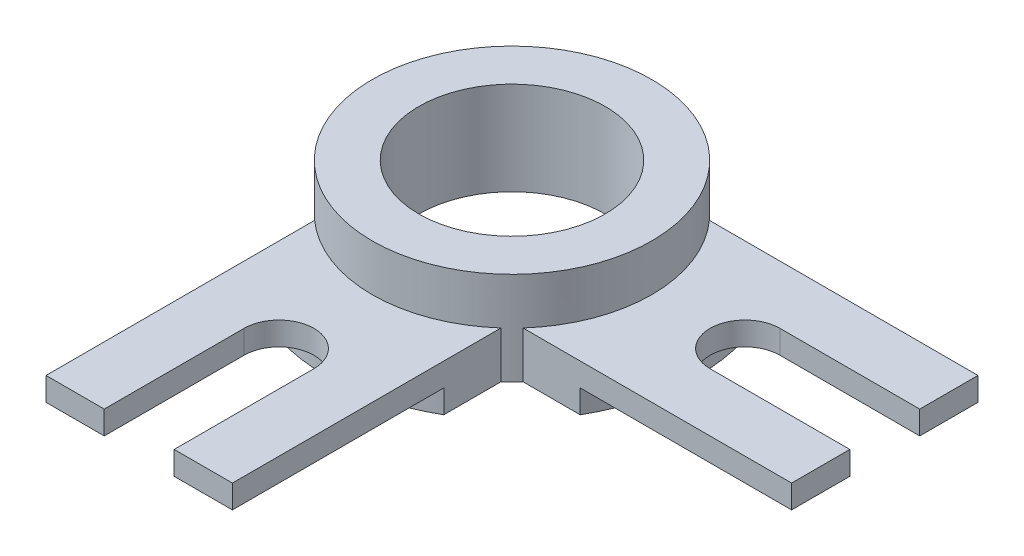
ISO-10303-21;
HEADER;
FILE_DESCRIPTION(('STEP AP214'),'2;1');
FILE_NAME('part.step','',(''),(''),'','','');
FILE_SCHEMA(('AUTOMOTIVE_DESIGN { 1 0 10303 214 1 1 1 1 }'));
ENDSEC;
DATA;
#1=APPLICATION_CONTEXT('core data for automotive mechanical design processes');
#2=APPLICATION_PROTOCOL_DEFINITION('international standard','automotive_design',2000,#1);
#3=PRODUCT_CONTEXT('',#1,'mechanical');
#4=PRODUCT('Part','Part','',(#3));
#5=PRODUCT_RELATED_PRODUCT_CATEGORY('part','',(#4));
#6=PRODUCT_DEFINITION_FORMATION('','',#4);
#7=PRODUCT_DEFINITION_CONTEXT('part definition',#1,'design');
#8=PRODUCT_DEFINITION('design','',#6,#7);
#9=PRODUCT_DEFINITION_SHAPE('','',#8);
#10=(LENGTH_UNIT() NAMED_UNIT(*) SI_UNIT(.MILLI.,.METRE.));
#11=(NAMED_UNIT(*) PLANE_ANGLE_UNIT() SI_UNIT($,.RADIAN.));
#12=(NAMED_UNIT(*) SI_UNIT($,.STERADIAN.) SOLID_ANGLE_UNIT());
#13=UNCERTAINTY_MEASURE_WITH_UNIT(LENGTH_MEASURE(1.E-05),#10,'distance_accuracy_value','');
#14=(GEOMETRIC_REPRESENTATION_CONTEXT(3) GLOBAL_UNCERTAINTY_ASSIGNED_CONTEXT((#13)) GLOBAL_UNIT_ASSIGNED_CONTEXT((#10,
#11,#12)) REPRESENTATION_CONTEXT('',''));
#15=CARTESIAN_POINT('',(0.,0.,0.));
#16=DIRECTION('',(0.,0.,1.));
#17=DIRECTION('',(1.,0.,0.));
#18=AXIS2_PLACEMENT_3D('',#15,#16,#17);
#19=CARTESIAN_POINT('',(-20.0000000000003,10.,79.9999999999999));
#20=DIRECTION('',(0.,0.,1.));
#21=DIRECTION('',(1.,0.,0.));
#22=AXIS2_PLACEMENT_3D('',#19,#20,#21);
#23=PLANE('',#22);
#24=DIRECTION('',(0.,1.,0.));
#25=VECTOR('',#24,1.);
#26=CARTESIAN_POINT('',(7.49999999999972,0.,80.));
#27=LINE('',#26,#25);
#28=CARTESIAN_POINT('',(7.49999999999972,5.,80.));
#29=VERTEX_POINT('',#28);
#30=CARTESIAN_POINT('',(7.49999999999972,10.,80.));
#31=VERTEX_POINT('',#30);
#32=EDGE_CURVE('E199',#29,#31,#27,.T.);
#33=ORIENTED_EDGE('',*,*,#32,.F.);
#34=DIRECTION('',(1.,0.,0.));
#35=VECTOR('',#34,1.);
#36=CARTESIAN_POINT('',(-20.0000000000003,5.,79.9999999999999));
#37=LINE('',#36,#35);
#38=CARTESIAN_POINT('',(19.9999999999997,5.,80.0000000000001));
#39=VERTEX_POINT('',#38);
#40=EDGE_CURVE('E335',#29,#39,#37,.T.);
#41=ORIENTED_EDGE('',*,*,#40,.T.);
#42=DIRECTION('',(0.,-1.,0.));
#43=VECTOR('',#42,1.);
#44=CARTESIAN_POINT('',(19.9999999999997,10.,80.0000000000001));
#45=LINE('',#44,#43);
#46=CARTESIAN_POINT('',(19.9999999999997,10.,80.0000000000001));
#47=VERTEX_POINT('',#46);
#48=EDGE_CURVE('E209',#47,#39,#45,.T.);
#49=ORIENTED_EDGE('',*,*,#48,.F.);
#50=DIRECTION('',(-1.,0.,0.));
#51=VECTOR('',#50,1.);
#52=CARTESIAN_POINT('',(-20.0000000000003,10.,79.9999999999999));
#53=LINE('',#52,#51);
#54=EDGE_CURVE('E317',#47,#31,#53,.T.);
#55=ORIENTED_EDGE('',*,*,#54,.T.);
#56=EDGE_LOOP('',(#33,#41,#49,#55));
#57=FACE_BOUND('',#56,.T.);
#58=ADVANCED_FACE('F33',(#57),#23,.T.);
#59=CARTESIAN_POINT('',(0.,0.,0.));
#60=DIRECTION('',(0.,1.,0.));
#61=DIRECTION('',(0.,0.,1.));
#62=AXIS2_PLACEMENT_3D('',#59,#60,#61);
#63=PLANE('',#62);
#64=CARTESIAN_POINT('',(0.,0.,0.));
#65=DIRECTION('',(0.,1.,0.));
#66=DIRECTION('',(0.,0.,1.));
#67=AXIS2_PLACEMENT_3D('',#64,#65,#66);
#68=CIRCLE('',#67,20.);
#69=CARTESIAN_POINT('',(0.,0.,20.));
#70=VERTEX_POINT('',#69);
#71=EDGE_CURVE('E180',#70,#70,#68,.T.);
#72=ORIENTED_EDGE('',*,*,#71,.T.);
#73=EDGE_LOOP('',(#72));
#74=FACE_BOUND('',#73,.T.);
#75=CARTESIAN_POINT('',(0.,0.,0.));
#76=DIRECTION('',(0.,-1.,0.));
#77=DIRECTION('',(1.,0.,0.));
#78=AXIS2_PLACEMENT_3D('',#75,#76,#77);
#79=CIRCLE('',#78,40.);
#80=CARTESIAN_POINT('',(19.9999999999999,0.,34.6410161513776));
#81=VERTEX_POINT('',#80);
#82=CARTESIAN_POINT('',(-20.0000000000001,0.,34.6410161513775));
#83=VERTEX_POINT('',#82);
#84=EDGE_CURVE('E170',#81,#83,#79,.T.);
#85=ORIENTED_EDGE('',*,*,#84,.T.);
#86=DIRECTION('',(0.,0.,-1.));
#87=VECTOR('',#86,1.);
#88=CARTESIAN_POINT('',(-20.,0.,0.));
#89=LINE('',#88,#87);
#90=CARTESIAN_POINT('',(-20.0000000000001,0.,22.3606797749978));
#91=VERTEX_POINT('',#90);
#92=EDGE_CURVE('E194',#83,#91,#89,.T.);
#93=ORIENTED_EDGE('',*,*,#92,.T.);
#94=CARTESIAN_POINT('',(0.,0.,0.));
#95=DIRECTION('',(0.,1.,0.));
#96=DIRECTION('',(0.,0.,1.));
#97=AXIS2_PLACEMENT_3D('',#94,#95,#96);
#98=CIRCLE('',#97,30.);
#99=CARTESIAN_POINT('',(22.3606797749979,0.,-20.));
#100=VERTEX_POINT('',#99);
#101=EDGE_CURVE('E281',#100,#91,#98,.T.);
#102=ORIENTED_EDGE('',*,*,#101,.F.);
#103=DIRECTION('',(1.,0.,0.));
#104=VECTOR('',#103,1.);
#105=CARTESIAN_POINT('',(0.,0.,-20.));
#106=LINE('',#105,#104);
#107=CARTESIAN_POINT('',(34.6410161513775,0.,-20.));
#108=VERTEX_POINT('',#107);
#109=EDGE_CURVE('E247',#100,#108,#106,.T.);
#110=ORIENTED_EDGE('',*,*,#109,.T.);
#111=CARTESIAN_POINT('',(0.,0.,0.));
#112=DIRECTION('',(0.,-1.,0.));
#113=DIRECTION('',(0.,0.,-1.));
#114=AXIS2_PLACEMENT_3D('',#111,#112,#113);
#115=CIRCLE('',#114,40.);
#116=CARTESIAN_POINT('',(34.6410161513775,0.,20.));
#117=VERTEX_POINT('',#116);
#118=EDGE_CURVE('E208',#108,#117,#115,.T.);
#119=ORIENTED_EDGE('',*,*,#118,.T.);
#120=DIRECTION('',(-1.,0.,0.));
#121=VECTOR('',#120,1.);
#122=CARTESIAN_POINT('',(0.,0.,20.));
#123=LINE('',#122,#121);
#124=CARTESIAN_POINT('',(22.3606797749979,0.,20.));
#125=VERTEX_POINT('',#124);
#126=EDGE_CURVE('E256',#117,#125,#123,.T.);
#127=ORIENTED_EDGE('',*,*,#126,.T.);
#128=CARTESIAN_POINT('',(19.9999999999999,0.,22.360679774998));
#129=VERTEX_POINT('',#128);
#130=EDGE_CURVE('E192',#129,#125,#98,.T.);
#131=ORIENTED_EDGE('',*,*,#130,.F.);
#132=DIRECTION('',(0.,0.,1.));
#133=VECTOR('',#132,1.);
#134=CARTESIAN_POINT('',(20.,0.,0.));
#135=LINE('',#134,#133);
#136=EDGE_CURVE('E188',#129,#81,#135,.T.);
#137=ORIENTED_EDGE('',*,*,#136,.T.);
#138=EDGE_LOOP('',(#85,#93,#102,#110,#119,#127,#131,#137));
#139=FACE_BOUND('',#138,.T.);
#140=ADVANCED_FACE('F190',(#74,#139),#63,.F.);
#141=CARTESIAN_POINT('',(-20.,10.,0.));
#142=DIRECTION('',(-1.,0.,0.));
#143=DIRECTION('',(0.,0.,1.));
#144=AXIS2_PLACEMENT_3D('',#141,#142,#143);
#145=PLANE('',#144);
#146=DIRECTION('',(0.,-1.,0.));
#147=VECTOR('',#146,1.);
#148=CARTESIAN_POINT('',(-20.0000000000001,5.,34.6410161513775));
#149=LINE('',#148,#147);
#150=CARTESIAN_POINT('',(-20.0000000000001,5.,34.6410161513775));
#151=VERTEX_POINT('',#150);
#152=EDGE_CURVE('E175',#83,#151,#149,.F.);
#153=ORIENTED_EDGE('',*,*,#152,.T.);
#154=DIRECTION('',(0.,0.,1.));
#155=VECTOR('',#154,1.);
#156=CARTESIAN_POINT('',(-20.,5.,0.));
#157=LINE('',#156,#155);
#158=CARTESIAN_POINT('',(-20.0000000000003,5.,79.9999999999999));
#159=VERTEX_POINT('',#158);
#160=EDGE_CURVE('E304',#151,#159,#157,.T.);
#161=ORIENTED_EDGE('',*,*,#160,.T.);
#162=DIRECTION('',(0.,-1.,0.));
#163=VECTOR('',#162,1.);
#164=CARTESIAN_POINT('',(-20.0000000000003,10.,79.9999999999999));
#165=LINE('',#164,#163);
#166=CARTESIAN_POINT('',(-20.0000000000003,10.,79.9999999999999));
#167=VERTEX_POINT('',#166);
#168=EDGE_CURVE('E205',#167,#159,#165,.T.);
#169=ORIENTED_EDGE('',*,*,#168,.F.);
#170=DIRECTION('',(0.,0.,-1.));
#171=VECTOR('',#170,1.);
#172=CARTESIAN_POINT('',(-20.,10.,0.));
#173=LINE('',#172,#171);
#174=CARTESIAN_POINT('',(-20.0000000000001,10.,22.3606797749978));
#175=VERTEX_POINT('',#174);
#176=EDGE_CURVE('E202',#167,#175,#173,.T.);
#177=ORIENTED_EDGE('',*,*,#176,.T.);
#178=DIRECTION('',(0.,-1.,0.));
#179=VECTOR('',#178,1.);
#180=CARTESIAN_POINT('',(-20.0000000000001,20.,22.3606797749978));
#181=LINE('',#180,#179);
#182=EDGE_CURVE('E296',#91,#175,#181,.F.);
#183=ORIENTED_EDGE('',*,*,#182,.F.);
#184=ORIENTED_EDGE('',*,*,#92,.F.);
#185=EDGE_LOOP('',(#153,#161,#169,#177,#183,#184));
#186=FACE_BOUND('',#185,.T.);
#187=ADVANCED_FACE('F327',(#186),#145,.T.);
#188=CARTESIAN_POINT('',(20.,10.,0.));
#189=DIRECTION('',(1.,0.,0.));
#190=DIRECTION('',(0.,0.,-1.));
#191=AXIS2_PLACEMENT_3D('',#188,#189,#190);
#192=PLANE('',#191);
#193=ORIENTED_EDGE('',*,*,#48,.T.);
#194=DIRECTION('',(0.,0.,-1.));
#195=VECTOR('',#194,1.);
#196=CARTESIAN_POINT('',(20.,5.,0.));
#197=LINE('',#196,#195);
#198=CARTESIAN_POINT('',(19.9999999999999,5.,34.6410161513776));
#199=VERTEX_POINT('',#198);
#200=EDGE_CURVE('E189',#39,#199,#197,.T.);
#201=ORIENTED_EDGE('',*,*,#200,.T.);
#202=DIRECTION('',(0.,-1.,0.));
#203=VECTOR('',#202,1.);
#204=CARTESIAN_POINT('',(19.9999999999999,5.,34.6410161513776));
#205=LINE('',#204,#203);
#206=EDGE_CURVE('E12',#199,#81,#205,.T.);
#207=ORIENTED_EDGE('',*,*,#206,.T.);
#208=ORIENTED_EDGE('',*,*,#136,.F.);
#209=DIRECTION('',(0.,-1.,0.));
#210=VECTOR('',#209,1.);
#211=CARTESIAN_POINT('',(19.9999999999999,20.,22.360679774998));
#212=LINE('',#211,#210);
#213=CARTESIAN_POINT('',(19.9999999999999,10.,22.360679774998));
#214=VERTEX_POINT('',#213);
#215=EDGE_CURVE('E294',#214,#129,#212,.T.);
#216=ORIENTED_EDGE('',*,*,#215,.F.);
#217=DIRECTION('',(0.,0.,1.));
#218=VECTOR('',#217,1.);
#219=CARTESIAN_POINT('',(20.,10.,0.));
#220=LINE('',#219,#218);
#221=EDGE_CURVE('E197',#214,#47,#220,.T.);
#222=ORIENTED_EDGE('',*,*,#221,.T.);
#223=EDGE_LOOP('',(#193,#201,#207,#208,#216,#222));
#224=FACE_BOUND('',#223,.T.);
#225=ADVANCED_FACE('F186',(#224),#192,.T.);
#226=ORIENTED_EDGE('',*,*,#168,.T.);
#227=DIRECTION('',(1.,0.,0.));
#228=VECTOR('',#227,1.);
#229=CARTESIAN_POINT('',(-20.0000000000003,5.,79.9999999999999));
#230=LINE('',#229,#228);
#231=CARTESIAN_POINT('',(-7.50000000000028,5.,80.));
#232=VERTEX_POINT('',#231);
#233=EDGE_CURVE('E298',#159,#232,#230,.T.);
#234=ORIENTED_EDGE('',*,*,#233,.T.);
#235=DIRECTION('',(0.,1.,0.));
#236=VECTOR('',#235,1.);
#237=CARTESIAN_POINT('',(-7.50000000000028,0.,80.));
#238=LINE('',#237,#236);
#239=CARTESIAN_POINT('',(-7.50000000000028,10.,80.));
#240=VERTEX_POINT('',#239);
#241=EDGE_CURVE('E56',#232,#240,#238,.T.);
#242=ORIENTED_EDGE('',*,*,#241,.T.);
#243=EDGE_CURVE('E316',#240,#167,#53,.T.);
#244=ORIENTED_EDGE('',*,*,#243,.T.);
#245=EDGE_LOOP('',(#226,#234,#242,#244));
#246=FACE_BOUND('',#245,.T.);
#247=ADVANCED_FACE('F302',(#246),#23,.T.);
#248=CARTESIAN_POINT('',(-1.78247987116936E-13,0.,50.));
#249=DIRECTION('',(0.,1.,0.));
#250=DIRECTION('',(0.,0.,1.));
#251=AXIS2_PLACEMENT_3D('',#248,#249,#250);
#252=CYLINDRICAL_SURFACE('',#251,7.5);
#253=CARTESIAN_POINT('',(-1.78247987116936E-13,5.,50.));
#254=DIRECTION('',(0.,-1.,0.));
#255=DIRECTION('',(0.,0.,-1.));
#256=AXIS2_PLACEMENT_3D('',#253,#254,#255);
#257=CIRCLE('',#256,7.5);
#258=CARTESIAN_POINT('',(7.49999999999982,5.,50.));
#259=VERTEX_POINT('',#258);
#260=CARTESIAN_POINT('',(-7.50000000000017,5.,50.));
#261=VERTEX_POINT('',#260);
#262=EDGE_CURVE('E48',#259,#261,#257,.F.);
#263=ORIENTED_EDGE('',*,*,#262,.F.);
#264=DIRECTION('',(0.,1.,0.));
#265=VECTOR('',#264,1.);
#266=CARTESIAN_POINT('',(7.49999999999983,0.,50.));
#267=LINE('',#266,#265);
#268=CARTESIAN_POINT('',(7.49999999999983,10.,50.));
#269=VERTEX_POINT('',#268);
#270=EDGE_CURVE('E195',#259,#269,#267,.T.);
#271=ORIENTED_EDGE('',*,*,#270,.T.);
#272=CARTESIAN_POINT('',(-1.78247987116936E-13,10.,50.));
#273=DIRECTION('',(0.,1.,0.));
#274=DIRECTION('',(-1.,0.,0.));
#275=AXIS2_PLACEMENT_3D('',#272,#273,#274);
#276=CIRCLE('',#275,7.5);
#277=CARTESIAN_POINT('',(-7.50000000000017,10.,50.));
#278=VERTEX_POINT('',#277);
#279=EDGE_CURVE('E339',#269,#278,#276,.T.);
#280=ORIENTED_EDGE('',*,*,#279,.T.);
#281=DIRECTION('',(0.,1.,0.));
#282=VECTOR('',#281,1.);
#283=CARTESIAN_POINT('',(-7.50000000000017,0.,50.));
#284=LINE('',#283,#282);
#285=EDGE_CURVE('E310',#261,#278,#284,.T.);
#286=ORIENTED_EDGE('',*,*,#285,.F.);
#287=EDGE_LOOP('',(#263,#271,#280,#286));
#288=FACE_BOUND('',#287,.T.);
#289=ADVANCED_FACE('F389',(#288),#252,.F.);
#290=CARTESIAN_POINT('',(7.49999999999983,0.,50.));
#291=DIRECTION('',(1.,0.,0.));
#292=DIRECTION('',(0.,0.,-1.));
#293=AXIS2_PLACEMENT_3D('',#290,#291,#292);
#294=PLANE('',#293);
#295=DIRECTION('',(0.,0.,-1.));
#296=VECTOR('',#295,1.);
#297=CARTESIAN_POINT('',(7.49999999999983,5.,50.));
#298=LINE('',#297,#296);
#299=EDGE_CURVE('E349',#29,#259,#298,.T.);
#300=ORIENTED_EDGE('',*,*,#299,.F.);
#301=ORIENTED_EDGE('',*,*,#32,.T.);
#302=DIRECTION('',(0.,0.,-1.));
#303=VECTOR('',#302,1.);
#304=CARTESIAN_POINT('',(7.49999999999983,10.,50.));
#305=LINE('',#304,#303);
#306=EDGE_CURVE('E313',#31,#269,#305,.T.);
#307=ORIENTED_EDGE('',*,*,#306,.T.);
#308=ORIENTED_EDGE('',*,*,#270,.F.);
#309=EDGE_LOOP('',(#300,#301,#307,#308));
#310=FACE_BOUND('',#309,.T.);
#311=ADVANCED_FACE('F394',(#310),#294,.F.);
#312=CARTESIAN_POINT('',(-7.50000000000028,0.,80.));
#313=DIRECTION('',(-1.,0.,0.));
#314=DIRECTION('',(0.,0.,1.));
#315=AXIS2_PLACEMENT_3D('',#312,#313,#314);
#316=PLANE('',#315);
#317=DIRECTION('',(0.,0.,1.));
#318=VECTOR('',#317,1.);
#319=CARTESIAN_POINT('',(-7.50000000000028,5.,80.));
#320=LINE('',#319,#318);
#321=EDGE_CURVE('E41',#261,#232,#320,.T.);
#322=ORIENTED_EDGE('',*,*,#321,.F.);
#323=ORIENTED_EDGE('',*,*,#285,.T.);
#324=DIRECTION('',(0.,0.,1.));
#325=VECTOR('',#324,1.);
#326=CARTESIAN_POINT('',(-7.50000000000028,10.,80.));
#327=LINE('',#326,#325);
#328=EDGE_CURVE('E308',#278,#240,#327,.T.);
#329=ORIENTED_EDGE('',*,*,#328,.T.);
#330=ORIENTED_EDGE('',*,*,#241,.F.);
#331=EDGE_LOOP('',(#322,#323,#329,#330));
#332=FACE_BOUND('',#331,.T.);
#333=ADVANCED_FACE('F306',(#332),#316,.F.);
#334=CARTESIAN_POINT('',(80.,10.,20.));
#335=DIRECTION('',(1.,0.,0.));
#336=DIRECTION('',(0.,0.,-1.));
#337=AXIS2_PLACEMENT_3D('',#334,#335,#336);
#338=PLANE('',#337);
#339=DIRECTION('',(0.,1.,0.));
#340=VECTOR('',#339,1.);
#341=CARTESIAN_POINT('',(80.,0.,-7.5));
#342=LINE('',#341,#340);
#343=CARTESIAN_POINT('',(80.,5.,-7.5));
#344=VERTEX_POINT('',#343);
#345=CARTESIAN_POINT('',(80.,10.,-7.5));
#346=VERTEX_POINT('',#345);
#347=EDGE_CURVE('E248',#344,#346,#342,.T.);
#348=ORIENTED_EDGE('',*,*,#347,.F.);
#349=DIRECTION('',(0.,0.,-1.));
#350=VECTOR('',#349,1.);
#351=CARTESIAN_POINT('',(80.,5.,20.));
#352=LINE('',#351,#350);
#353=CARTESIAN_POINT('',(80.,5.,-20.));
#354=VERTEX_POINT('',#353);
#355=EDGE_CURVE('E226',#344,#354,#352,.T.);
#356=ORIENTED_EDGE('',*,*,#355,.T.);
#357=DIRECTION('',(0.,-1.,0.));
#358=VECTOR('',#357,1.);
#359=CARTESIAN_POINT('',(80.,10.,-20.));
#360=LINE('',#359,#358);
#361=CARTESIAN_POINT('',(80.,10.,-20.));
#362=VERTEX_POINT('',#361);
#363=EDGE_CURVE('E263',#362,#354,#360,.T.);
#364=ORIENTED_EDGE('',*,*,#363,.F.);
#365=DIRECTION('',(0.,0.,1.));
#366=VECTOR('',#365,1.);
#367=CARTESIAN_POINT('',(80.,10.,20.));
#368=LINE('',#367,#366);
#369=EDGE_CURVE('E257',#362,#346,#368,.T.);
#370=ORIENTED_EDGE('',*,*,#369,.T.);
#371=EDGE_LOOP('',(#348,#356,#364,#370));
#372=FACE_BOUND('',#371,.T.);
#373=ADVANCED_FACE('F424',(#372),#338,.T.);
#374=CARTESIAN_POINT('',(0.,10.,20.));
#375=DIRECTION('',(0.,0.,1.));
#376=DIRECTION('',(1.,0.,0.));
#377=AXIS2_PLACEMENT_3D('',#374,#375,#376);
#378=PLANE('',#377);
#379=DIRECTION('',(0.,-1.,0.));
#380=VECTOR('',#379,1.);
#381=CARTESIAN_POINT('',(34.6410161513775,5.,20.));
#382=LINE('',#381,#380);
#383=CARTESIAN_POINT('',(34.6410161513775,5.,20.));
#384=VERTEX_POINT('',#383);
#385=EDGE_CURVE('E232',#117,#384,#382,.F.);
#386=ORIENTED_EDGE('',*,*,#385,.T.);
#387=DIRECTION('',(1.,0.,0.));
#388=VECTOR('',#387,1.);
#389=CARTESIAN_POINT('',(0.,5.,20.));
#390=LINE('',#389,#388);
#391=CARTESIAN_POINT('',(80.,5.,20.));
#392=VERTEX_POINT('',#391);
#393=EDGE_CURVE('E221',#384,#392,#390,.T.);
#394=ORIENTED_EDGE('',*,*,#393,.T.);
#395=DIRECTION('',(0.,-1.,0.));
#396=VECTOR('',#395,1.);
#397=CARTESIAN_POINT('',(80.,10.,20.));
#398=LINE('',#397,#396);
#399=CARTESIAN_POINT('',(80.,10.,20.));
#400=VERTEX_POINT('',#399);
#401=EDGE_CURVE('E267',#400,#392,#398,.T.);
#402=ORIENTED_EDGE('',*,*,#401,.F.);
#403=DIRECTION('',(-1.,0.,0.));
#404=VECTOR('',#403,1.);
#405=CARTESIAN_POINT('',(0.,10.,20.));
#406=LINE('',#405,#404);
#407=CARTESIAN_POINT('',(22.3606797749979,10.,20.));
#408=VERTEX_POINT('',#407);
#409=EDGE_CURVE('E260',#400,#408,#406,.T.);
#410=ORIENTED_EDGE('',*,*,#409,.T.);
#411=DIRECTION('',(0.,-1.,0.));
#412=VECTOR('',#411,1.);
#413=CARTESIAN_POINT('',(22.3606797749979,20.,20.));
#414=LINE('',#413,#412);
#415=EDGE_CURVE('E275',#125,#408,#414,.F.);
#416=ORIENTED_EDGE('',*,*,#415,.F.);
#417=ORIENTED_EDGE('',*,*,#126,.F.);
#418=EDGE_LOOP('',(#386,#394,#402,#410,#416,#417));
#419=FACE_BOUND('',#418,.T.);
#420=ADVANCED_FACE('F420',(#419),#378,.T.);
#421=CARTESIAN_POINT('',(0.,10.,-20.));
#422=DIRECTION('',(0.,0.,-1.));
#423=DIRECTION('',(-1.,0.,0.));
#424=AXIS2_PLACEMENT_3D('',#421,#422,#423);
#425=PLANE('',#424);
#426=ORIENTED_EDGE('',*,*,#363,.T.);
#427=DIRECTION('',(-1.,0.,0.));
#428=VECTOR('',#427,1.);
#429=CARTESIAN_POINT('',(0.,5.,-20.));
#430=LINE('',#429,#428);
#431=CARTESIAN_POINT('',(34.6410161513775,5.,-20.));
#432=VERTEX_POINT('',#431);
#433=EDGE_CURVE('E229',#354,#432,#430,.T.);
#434=ORIENTED_EDGE('',*,*,#433,.T.);
#435=DIRECTION('',(0.,-1.,0.));
#436=VECTOR('',#435,1.);
#437=CARTESIAN_POINT('',(34.6410161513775,5.,-20.));
#438=LINE('',#437,#436);
#439=EDGE_CURVE('E288',#432,#108,#438,.T.);
#440=ORIENTED_EDGE('',*,*,#439,.T.);
#441=ORIENTED_EDGE('',*,*,#109,.F.);
#442=DIRECTION('',(0.,-1.,0.));
#443=VECTOR('',#442,1.);
#444=CARTESIAN_POINT('',(22.3606797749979,20.,-20.));
#445=LINE('',#444,#443);
#446=CARTESIAN_POINT('',(22.3606797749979,10.,-20.));
#447=VERTEX_POINT('',#446);
#448=EDGE_CURVE('E270',#447,#100,#445,.T.);
#449=ORIENTED_EDGE('',*,*,#448,.F.);
#450=DIRECTION('',(1.,0.,0.));
#451=VECTOR('',#450,1.);
#452=CARTESIAN_POINT('',(0.,10.,-20.));
#453=LINE('',#452,#451);
#454=EDGE_CURVE('E253',#447,#362,#453,.T.);
#455=ORIENTED_EDGE('',*,*,#454,.T.);
#456=EDGE_LOOP('',(#426,#434,#440,#441,#449,#455));
#457=FACE_BOUND('',#456,.T.);
#458=ADVANCED_FACE('F423',(#457),#425,.T.);
#459=ORIENTED_EDGE('',*,*,#401,.T.);
#460=DIRECTION('',(0.,0.,-1.));
#461=VECTOR('',#460,1.);
#462=CARTESIAN_POINT('',(80.,5.,20.));
#463=LINE('',#462,#461);
#464=CARTESIAN_POINT('',(80.,5.,7.5));
#465=VERTEX_POINT('',#464);
#466=EDGE_CURVE('E218',#392,#465,#463,.T.);
#467=ORIENTED_EDGE('',*,*,#466,.T.);
#468=DIRECTION('',(0.,1.,0.));
#469=VECTOR('',#468,1.);
#470=CARTESIAN_POINT('',(80.,0.,7.5));
#471=LINE('',#470,#469);
#472=CARTESIAN_POINT('',(80.,10.,7.5));
#473=VERTEX_POINT('',#472);
#474=EDGE_CURVE('E250',#465,#473,#471,.T.);
#475=ORIENTED_EDGE('',*,*,#474,.T.);
#476=EDGE_CURVE('E255',#473,#400,#368,.T.);
#477=ORIENTED_EDGE('',*,*,#476,.T.);
#478=EDGE_LOOP('',(#459,#467,#475,#477));
#479=FACE_BOUND('',#478,.T.);
#480=ADVANCED_FACE('F415',(#479),#338,.T.);
#481=CARTESIAN_POINT('',(50.,0.,0.));
#482=DIRECTION('',(0.,1.,0.));
#483=DIRECTION('',(0.,0.,1.));
#484=AXIS2_PLACEMENT_3D('',#481,#482,#483);
#485=CYLINDRICAL_SURFACE('',#484,7.5);
#486=CARTESIAN_POINT('',(50.,5.,0.));
#487=DIRECTION('',(0.,-1.,0.));
#488=DIRECTION('',(0.,0.,-1.));
#489=AXIS2_PLACEMENT_3D('',#486,#487,#488);
#490=CIRCLE('',#489,7.5);
#491=CARTESIAN_POINT('',(50.,5.,-7.5));
#492=VERTEX_POINT('',#491);
#493=CARTESIAN_POINT('',(50.,5.,7.5));
#494=VERTEX_POINT('',#493);
#495=EDGE_CURVE('E214',#492,#494,#490,.F.);
#496=ORIENTED_EDGE('',*,*,#495,.F.);
#497=DIRECTION('',(0.,1.,0.));
#498=VECTOR('',#497,1.);
#499=CARTESIAN_POINT('',(50.,0.,-7.5));
#500=LINE('',#499,#498);
#501=CARTESIAN_POINT('',(50.,10.,-7.5));
#502=VERTEX_POINT('',#501);
#503=EDGE_CURVE('E245',#492,#502,#500,.T.);
#504=ORIENTED_EDGE('',*,*,#503,.T.);
#505=CARTESIAN_POINT('',(50.,10.,0.));
#506=DIRECTION('',(0.,1.,0.));
#507=DIRECTION('',(0.,0.,1.));
#508=AXIS2_PLACEMENT_3D('',#505,#506,#507);
#509=CIRCLE('',#508,7.5);
#510=CARTESIAN_POINT('',(50.,10.,7.5));
#511=VERTEX_POINT('',#510);
#512=EDGE_CURVE('E235',#502,#511,#509,.T.);
#513=ORIENTED_EDGE('',*,*,#512,.T.);
#514=DIRECTION('',(0.,1.,0.));
#515=VECTOR('',#514,1.);
#516=CARTESIAN_POINT('',(50.,0.,7.5));
#517=LINE('',#516,#515);
#518=EDGE_CURVE('E244',#494,#511,#517,.T.);
#519=ORIENTED_EDGE('',*,*,#518,.F.);
#520=EDGE_LOOP('',(#496,#504,#513,#519));
#521=FACE_BOUND('',#520,.T.);
#522=ADVANCED_FACE('F410',(#521),#485,.F.);
#523=CARTESIAN_POINT('',(50.,0.,-7.5));
#524=DIRECTION('',(0.,0.,-1.));
#525=DIRECTION('',(-1.,0.,0.));
#526=AXIS2_PLACEMENT_3D('',#523,#524,#525);
#527=PLANE('',#526);
#528=DIRECTION('',(-1.,0.,0.));
#529=VECTOR('',#528,1.);
#530=CARTESIAN_POINT('',(50.,5.,-7.5));
#531=LINE('',#530,#529);
#532=EDGE_CURVE('E224',#344,#492,#531,.T.);
#533=ORIENTED_EDGE('',*,*,#532,.F.);
#534=ORIENTED_EDGE('',*,*,#347,.T.);
#535=DIRECTION('',(-1.,0.,0.));
#536=VECTOR('',#535,1.);
#537=CARTESIAN_POINT('',(50.,10.,-7.5));
#538=LINE('',#537,#536);
#539=EDGE_CURVE('E241',#346,#502,#538,.T.);
#540=ORIENTED_EDGE('',*,*,#539,.T.);
#541=ORIENTED_EDGE('',*,*,#503,.F.);
#542=EDGE_LOOP('',(#533,#534,#540,#541));
#543=FACE_BOUND('',#542,.T.);
#544=ADVANCED_FACE('F378',(#543),#527,.F.);
#545=CARTESIAN_POINT('',(80.,0.,7.5));
#546=DIRECTION('',(0.,0.,1.));
#547=DIRECTION('',(1.,0.,0.));
#548=AXIS2_PLACEMENT_3D('',#545,#546,#547);
#549=PLANE('',#548);
#550=DIRECTION('',(1.,0.,0.));
#551=VECTOR('',#550,1.);
#552=CARTESIAN_POINT('',(80.,5.,7.5));
#553=LINE('',#552,#551);
#554=EDGE_CURVE('E286',#494,#465,#553,.T.);
#555=ORIENTED_EDGE('',*,*,#554,.F.);
#556=ORIENTED_EDGE('',*,*,#518,.T.);
#557=DIRECTION('',(1.,0.,0.));
#558=VECTOR('',#557,1.);
#559=CARTESIAN_POINT('',(80.,10.,7.5));
#560=LINE('',#559,#558);
#561=EDGE_CURVE('E238',#511,#473,#560,.T.);
#562=ORIENTED_EDGE('',*,*,#561,.T.);
#563=ORIENTED_EDGE('',*,*,#474,.F.);
#564=EDGE_LOOP('',(#555,#556,#562,#563));
#565=FACE_BOUND('',#564,.T.);
#566=ADVANCED_FACE('F374',(#565),#549,.F.);
#567=CARTESIAN_POINT('',(0.,20.,0.));
#568=DIRECTION('',(0.,-1.,0.));
#569=DIRECTION('',(0.,0.,-1.));
#570=AXIS2_PLACEMENT_3D('',#567,#568,#569);
#571=CYLINDRICAL_SURFACE('',#570,30.);
#572=ORIENTED_EDGE('',*,*,#101,.T.);
#573=ORIENTED_EDGE('',*,*,#182,.T.);
#574=CARTESIAN_POINT('',(0.,10.,0.));
#575=DIRECTION('',(0.,-1.,0.));
#576=DIRECTION('',(0.,0.,-1.));
#577=AXIS2_PLACEMENT_3D('',#574,#575,#576);
#578=CIRCLE('',#577,30.);
#579=EDGE_CURVE('E291',#214,#175,#578,.T.);
#580=ORIENTED_EDGE('',*,*,#579,.F.);
#581=ORIENTED_EDGE('',*,*,#215,.T.);
#582=ORIENTED_EDGE('',*,*,#130,.T.);
#583=ORIENTED_EDGE('',*,*,#415,.T.);
#584=CARTESIAN_POINT('',(0.,10.,0.));
#585=DIRECTION('',(0.,-1.,0.));
#586=DIRECTION('',(0.,0.,-1.));
#587=AXIS2_PLACEMENT_3D('',#584,#585,#586);
#588=CIRCLE('',#587,30.);
#589=EDGE_CURVE('E280',#447,#408,#588,.T.);
#590=ORIENTED_EDGE('',*,*,#589,.F.);
#591=ORIENTED_EDGE('',*,*,#448,.T.);
#592=EDGE_LOOP('',(#572,#573,#580,#581,#582,#583,#590,#591));
#593=FACE_BOUND('',#592,.T.);
#594=CARTESIAN_POINT('',(0.,20.,0.));
#595=DIRECTION('',(0.,1.,0.));
#596=DIRECTION('',(0.,0.,1.));
#597=AXIS2_PLACEMENT_3D('',#594,#595,#596);
#598=CIRCLE('',#597,30.);
#599=CARTESIAN_POINT('',(0.,20.,30.));
#600=VERTEX_POINT('',#599);
#601=EDGE_CURVE('E277',#600,#600,#598,.T.);
#602=ORIENTED_EDGE('',*,*,#601,.F.);
#603=EDGE_LOOP('',(#602));
#604=FACE_BOUND('',#603,.T.);
#605=ADVANCED_FACE('F35',(#593,#604),#571,.T.);
#606=CARTESIAN_POINT('',(0.,20.,0.));
#607=DIRECTION('',(0.,1.,0.));
#608=DIRECTION('',(0.,0.,1.));
#609=AXIS2_PLACEMENT_3D('',#606,#607,#608);
#610=PLANE('',#609);
#611=CARTESIAN_POINT('',(0.,20.,0.));
#612=DIRECTION('',(0.,1.,0.));
#613=DIRECTION('',(0.,0.,1.));
#614=AXIS2_PLACEMENT_3D('',#611,#612,#613);
#615=CIRCLE('',#614,20.);
#616=CARTESIAN_POINT('',(0.,20.,20.));
#617=VERTEX_POINT('',#616);
#618=EDGE_CURVE('E354',#617,#617,#615,.T.);
#619=ORIENTED_EDGE('',*,*,#618,.F.);
#620=EDGE_LOOP('',(#619));
#621=FACE_BOUND('',#620,.T.);
#622=ORIENTED_EDGE('',*,*,#601,.T.);
#623=EDGE_LOOP('',(#622));
#624=FACE_BOUND('',#623,.T.);
#625=ADVANCED_FACE('F367',(#621,#624),#610,.T.);
#626=CARTESIAN_POINT('',(0.,10.,-20.));
#627=DIRECTION('',(0.,-1.,0.));
#628=DIRECTION('',(0.,0.,-1.));
#629=AXIS2_PLACEMENT_3D('',#626,#627,#628);
#630=PLANE('',#629);
#631=ORIENTED_EDGE('',*,*,#512,.F.);
#632=ORIENTED_EDGE('',*,*,#539,.F.);
#633=ORIENTED_EDGE('',*,*,#369,.F.);
#634=ORIENTED_EDGE('',*,*,#454,.F.);
#635=ORIENTED_EDGE('',*,*,#589,.T.);
#636=ORIENTED_EDGE('',*,*,#409,.F.);
#637=ORIENTED_EDGE('',*,*,#476,.F.);
#638=ORIENTED_EDGE('',*,*,#561,.F.);
#639=EDGE_LOOP('',(#631,#632,#633,#634,#635,#636,#637,#638));
#640=FACE_BOUND('',#639,.T.);
#641=ADVANCED_FACE('F370',(#640),#630,.F.);
#642=CARTESIAN_POINT('',(20.,5.,0.));
#643=DIRECTION('',(0.,-1.,0.));
#644=DIRECTION('',(0.,0.,-1.));
#645=AXIS2_PLACEMENT_3D('',#642,#643,#644);
#646=PLANE('',#645);
#647=ORIENTED_EDGE('',*,*,#355,.F.);
#648=ORIENTED_EDGE('',*,*,#532,.T.);
#649=ORIENTED_EDGE('',*,*,#495,.T.);
#650=ORIENTED_EDGE('',*,*,#554,.T.);
#651=ORIENTED_EDGE('',*,*,#466,.F.);
#652=ORIENTED_EDGE('',*,*,#393,.F.);
#653=CARTESIAN_POINT('',(0.,5.,0.));
#654=DIRECTION('',(0.,-1.,0.));
#655=DIRECTION('',(0.,0.,-1.));
#656=AXIS2_PLACEMENT_3D('',#653,#654,#655);
#657=CIRCLE('',#656,40.);
#658=EDGE_CURVE('E211',#432,#384,#657,.T.);
#659=ORIENTED_EDGE('',*,*,#658,.F.);
#660=ORIENTED_EDGE('',*,*,#433,.F.);
#661=EDGE_LOOP('',(#647,#648,#649,#650,#651,#652,#659,#660));
#662=FACE_BOUND('',#661,.T.);
#663=ADVANCED_FACE('F404',(#662),#646,.T.);
#664=CARTESIAN_POINT('',(0.,5.,0.));
#665=DIRECTION('',(0.,-1.,0.));
#666=DIRECTION('',(0.,0.,-1.));
#667=AXIS2_PLACEMENT_3D('',#664,#665,#666);
#668=CYLINDRICAL_SURFACE('',#667,40.);
#669=ORIENTED_EDGE('',*,*,#118,.F.);
#670=ORIENTED_EDGE('',*,*,#439,.F.);
#671=ORIENTED_EDGE('',*,*,#658,.T.);
#672=ORIENTED_EDGE('',*,*,#385,.F.);
#673=EDGE_LOOP('',(#669,#670,#671,#672));
#674=FACE_BOUND('',#673,.T.);
#675=ADVANCED_FACE('F401',(#674),#668,.T.);
#676=CARTESIAN_POINT('',(20.,10.,0.));
#677=DIRECTION('',(0.,-1.,0.));
#678=DIRECTION('',(1.,0.,0.));
#679=AXIS2_PLACEMENT_3D('',#676,#677,#678);
#680=PLANE('',#679);
#681=ORIENTED_EDGE('',*,*,#279,.F.);
#682=ORIENTED_EDGE('',*,*,#306,.F.);
#683=ORIENTED_EDGE('',*,*,#54,.F.);
#684=ORIENTED_EDGE('',*,*,#221,.F.);
#685=ORIENTED_EDGE('',*,*,#579,.T.);
#686=ORIENTED_EDGE('',*,*,#176,.F.);
#687=ORIENTED_EDGE('',*,*,#243,.F.);
#688=ORIENTED_EDGE('',*,*,#328,.F.);
#689=EDGE_LOOP('',(#681,#682,#683,#684,#685,#686,#687,#688));
#690=FACE_BOUND('',#689,.T.);
#691=ADVANCED_FACE('F330',(#690),#680,.F.);
#692=CARTESIAN_POINT('',(19.9999999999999,5.,20.));
#693=DIRECTION('',(0.,-1.,0.));
#694=DIRECTION('',(0.,0.,-1.));
#695=AXIS2_PLACEMENT_3D('',#692,#693,#694);
#696=PLANE('',#695);
#697=ORIENTED_EDGE('',*,*,#40,.F.);
#698=ORIENTED_EDGE('',*,*,#299,.T.);
#699=ORIENTED_EDGE('',*,*,#262,.T.);
#700=ORIENTED_EDGE('',*,*,#321,.T.);
#701=ORIENTED_EDGE('',*,*,#233,.F.);
#702=ORIENTED_EDGE('',*,*,#160,.F.);
#703=CARTESIAN_POINT('',(0.,5.,0.));
#704=DIRECTION('',(0.,-1.,0.));
#705=DIRECTION('',(1.,0.,0.));
#706=AXIS2_PLACEMENT_3D('',#703,#704,#705);
#707=CIRCLE('',#706,40.);
#708=EDGE_CURVE('E179',#199,#151,#707,.T.);
#709=ORIENTED_EDGE('',*,*,#708,.F.);
#710=ORIENTED_EDGE('',*,*,#200,.F.);
#711=EDGE_LOOP('',(#697,#698,#699,#700,#701,#702,#709,#710));
#712=FACE_BOUND('',#711,.T.);
#713=ADVANCED_FACE('F297',(#712),#696,.T.);
#714=CARTESIAN_POINT('',(0.,5.,0.));
#715=DIRECTION('',(0.,-1.,0.));
#716=DIRECTION('',(0.,0.,-1.));
#717=AXIS2_PLACEMENT_3D('',#714,#715,#716);
#718=CYLINDRICAL_SURFACE('',#717,40.);
#719=ORIENTED_EDGE('',*,*,#84,.F.);
#720=ORIENTED_EDGE('',*,*,#206,.F.);
#721=ORIENTED_EDGE('',*,*,#708,.T.);
#722=ORIENTED_EDGE('',*,*,#152,.F.);
#723=EDGE_LOOP('',(#719,#720,#721,#722));
#724=FACE_BOUND('',#723,.T.);
#725=ADVANCED_FACE('F171',(#724),#718,.T.);
#726=CARTESIAN_POINT('',(0.,0.,0.));
#727=DIRECTION('',(0.,1.,0.));
#728=DIRECTION('',(0.,0.,1.));
#729=AXIS2_PLACEMENT_3D('',#726,#727,#728);
#730=CYLINDRICAL_SURFACE('',#729,20.);
#731=ORIENTED_EDGE('',*,*,#71,.F.);
#732=EDGE_LOOP('',(#731));
#733=FACE_BOUND('',#732,.T.);
#734=ORIENTED_EDGE('',*,*,#618,.T.);
#735=EDGE_LOOP('',(#734));
#736=FACE_BOUND('',#735,.T.);
#737=ADVANCED_FACE('F361',(#733,#736),#730,.F.);
#738=CLOSED_SHELL('',(#58,#140,#187,#225,#247,#289,#311,#333,#373,#420,#458,#480,#522,#544,#566,
#605,#625,#641,#663,#675,#691,#713,#725,#737));
#739=MANIFOLD_SOLID_BREP('B2',#738);
#740=ADVANCED_BREP_SHAPE_REPRESENTATION('',(#18,#739),#14);
#741=SHAPE_DEFINITION_REPRESENTATION(#9,#740);
ENDSEC;
END-ISO-10303-21;
